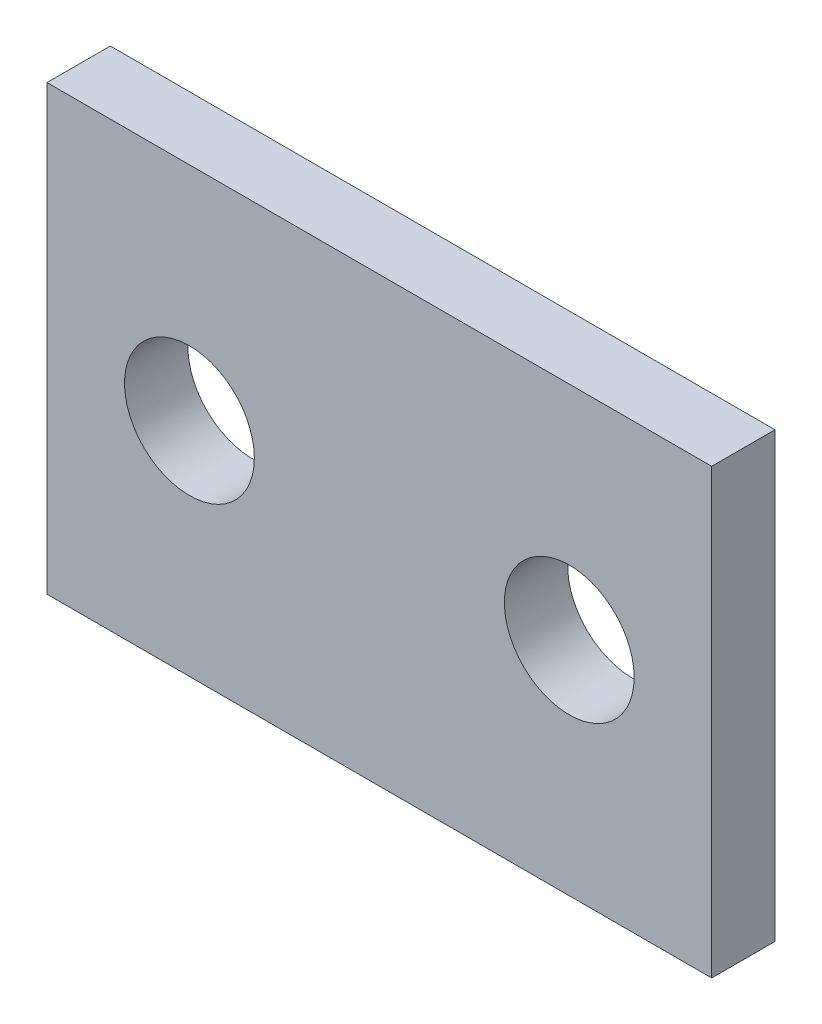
from build123d import *

# Parameters (mm, degrees)
ESQUISSE1_W             = 105
ESQUISSE1_H             = 70
EXTRUSION1_DEPTH        = 10
ESQUISSE2_R             = 10.25
ENL_V_MAT_EXTRU_1_DEPTH = 10


with BuildPart() as part:
    # Esquisse1 → Extrusion1 (new body)
    with BuildSketch(Plane.XY):
        with Locations((52.5, -35)):
            Rectangle(ESQUISSE1_W, ESQUISSE1_H)
    extrude(amount=EXTRUSION1_DEPTH)

    # Esquisse2 → Enl_v. mat.-Extru.1 (cut)
    with BuildSketch(Plane.XY.offset(10)):
        with Locations((22.5, -35)):
            Circle(ESQUISSE2_R)
        with Locations((82.5, -35)):
            Circle(ESQUISSE2_R)
    extrude(amount=-ENL_V_MAT_EXTRU_1_DEPTH, mode=Mode.SUBTRACT)


solid = part.part
